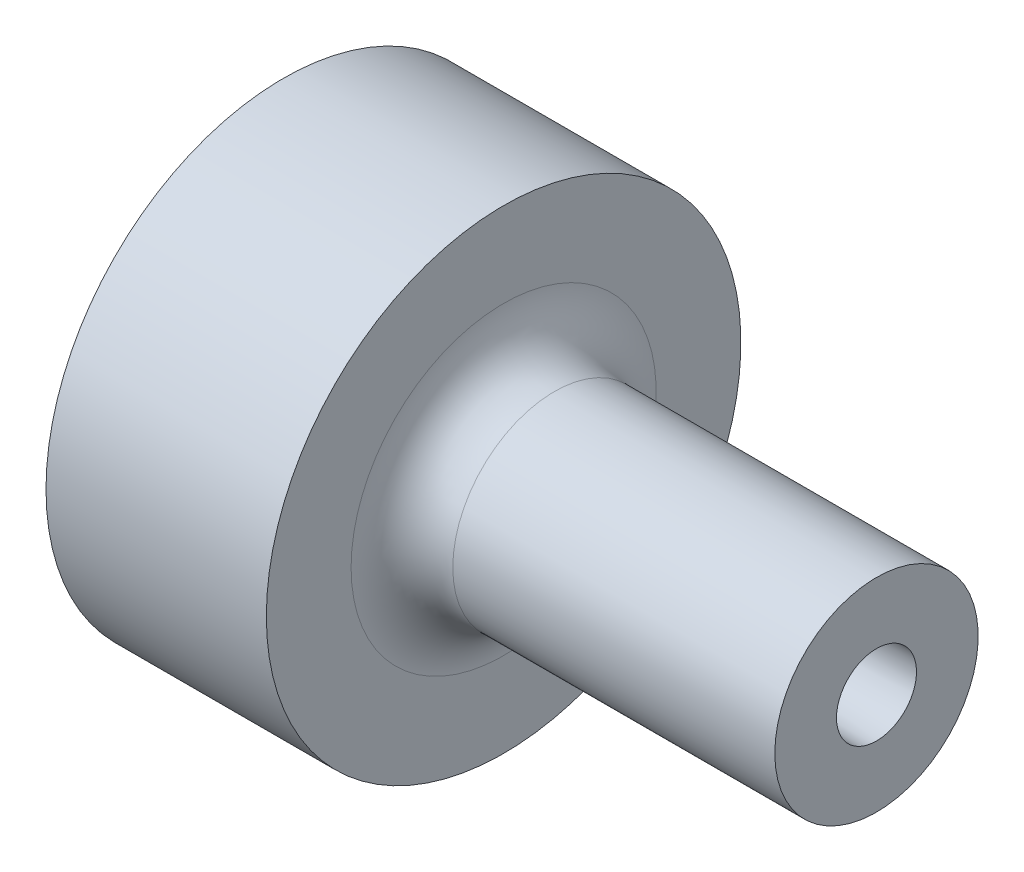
ISO-10303-21;
HEADER;
FILE_DESCRIPTION(('STEP AP214'),'2;1');
FILE_NAME('part.step','',(''),(''),'','','');
FILE_SCHEMA(('AUTOMOTIVE_DESIGN { 1 0 10303 214 1 1 1 1 }'));
ENDSEC;
DATA;
#1=APPLICATION_CONTEXT('core data for automotive mechanical design processes');
#2=APPLICATION_PROTOCOL_DEFINITION('international standard','automotive_design',2000,#1);
#3=PRODUCT_CONTEXT('',#1,'mechanical');
#4=PRODUCT('Part','Part','',(#3));
#5=PRODUCT_RELATED_PRODUCT_CATEGORY('part','',(#4));
#6=PRODUCT_DEFINITION_FORMATION('','',#4);
#7=PRODUCT_DEFINITION_CONTEXT('part definition',#1,'design');
#8=PRODUCT_DEFINITION('design','',#6,#7);
#9=PRODUCT_DEFINITION_SHAPE('','',#8);
#10=(LENGTH_UNIT() NAMED_UNIT(*) SI_UNIT(.MILLI.,.METRE.));
#11=(NAMED_UNIT(*) PLANE_ANGLE_UNIT() SI_UNIT($,.RADIAN.));
#12=(NAMED_UNIT(*) SI_UNIT($,.STERADIAN.) SOLID_ANGLE_UNIT());
#13=UNCERTAINTY_MEASURE_WITH_UNIT(LENGTH_MEASURE(1.E-05),#10,'distance_accuracy_value','');
#14=(GEOMETRIC_REPRESENTATION_CONTEXT(3) GLOBAL_UNCERTAINTY_ASSIGNED_CONTEXT((#13)) GLOBAL_UNIT_ASSIGNED_CONTEXT((#10,
#11,#12)) REPRESENTATION_CONTEXT('',''));
#15=CARTESIAN_POINT('',(0.,0.,0.));
#16=DIRECTION('',(0.,0.,1.));
#17=DIRECTION('',(1.,0.,0.));
#18=AXIS2_PLACEMENT_3D('',#15,#16,#17);
#19=CARTESIAN_POINT('',(0.,0.,0.));
#20=DIRECTION('',(-1.,0.,0.));
#21=DIRECTION('',(0.,0.,1.));
#22=AXIS2_PLACEMENT_3D('',#19,#20,#21);
#23=CYLINDRICAL_SURFACE('',#22,14.);
#24=CARTESIAN_POINT('',(13.,0.,0.));
#25=DIRECTION('',(-1.,0.,0.));
#26=DIRECTION('',(0.,0.,1.));
#27=AXIS2_PLACEMENT_3D('',#24,#25,#26);
#28=CIRCLE('',#27,14.);
#29=CARTESIAN_POINT('',(13.,0.,14.));
#30=VERTEX_POINT('',#29);
#31=EDGE_CURVE('E89',#30,#30,#28,.T.);
#32=ORIENTED_EDGE('',*,*,#31,.T.);
#33=EDGE_LOOP('',(#32));
#34=FACE_BOUND('',#33,.T.);
#35=CARTESIAN_POINT('',(0.,0.,0.));
#36=DIRECTION('',(-1.,0.,0.));
#37=DIRECTION('',(0.,0.,1.));
#38=AXIS2_PLACEMENT_3D('',#35,#36,#37);
#39=CIRCLE('',#38,14.);
#40=CARTESIAN_POINT('',(0.,0.,14.));
#41=VERTEX_POINT('',#40);
#42=EDGE_CURVE('E84',#41,#41,#39,.T.);
#43=ORIENTED_EDGE('',*,*,#42,.F.);
#44=EDGE_LOOP('',(#43));
#45=FACE_BOUND('',#44,.T.);
#46=CARTESIAN_POINT('',(6.5,-13.856406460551,-2.));
#47=CARTESIAN_POINT('',(6.61172417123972,-13.8564082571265,-1.99999534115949));
#48=CARTESIAN_POINT('',(6.72351471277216,-13.8577723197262,-1.99060664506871));
#49=CARTESIAN_POINT('',(6.9439746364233,-13.8630779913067,-1.95330740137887));
#50=CARTESIAN_POINT('',(7.05264079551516,-13.8670221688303,-1.92537839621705));
#51=CARTESIAN_POINT('',(7.26362870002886,-13.8770324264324,-1.85184738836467));
#52=CARTESIAN_POINT('',(7.36595507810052,-13.8830969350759,-1.80625847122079));
#53=CARTESIAN_POINT('',(7.56148972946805,-13.8966626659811,-1.69873175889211));
#54=CARTESIAN_POINT('',(7.65469934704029,-13.9041636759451,-1.63679637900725));
#55=CARTESIAN_POINT('',(7.83004829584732,-13.9198182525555,-1.49785346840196));
#56=CARTESIAN_POINT('',(7.91211171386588,-13.9279757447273,-1.42075056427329));
#57=CARTESIAN_POINT('',(8.06218155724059,-13.9439890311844,-1.25386707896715));
#58=CARTESIAN_POINT('',(8.13018723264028,-13.9518448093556,-1.16408582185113));
#59=CARTESIAN_POINT('',(8.25048909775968,-13.9664103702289,-0.973910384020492));
#60=CARTESIAN_POINT('',(8.30271571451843,-13.9731150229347,-0.873471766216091));
#61=CARTESIAN_POINT('',(8.38953073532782,-13.9845795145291,-0.665136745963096));
#62=CARTESIAN_POINT('',(8.4241199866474,-13.9893394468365,-0.557240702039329));
#63=CARTESIAN_POINT('',(8.47444920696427,-13.9963505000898,-0.337834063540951));
#64=CARTESIAN_POINT('',(8.49031606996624,-13.9986185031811,-0.226353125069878));
#65=CARTESIAN_POINT('',(8.5031438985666,-14.0004479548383,-0.00228956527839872));
#66=CARTESIAN_POINT('',(8.50010582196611,-14.0000095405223,0.110292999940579));
#67=CARTESIAN_POINT('',(8.47531062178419,-13.9964890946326,0.33249899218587));
#68=CARTESIAN_POINT('',(8.45369000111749,-13.9934263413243,0.442137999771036));
#69=CARTESIAN_POINT('',(8.39255744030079,-13.9850228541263,0.656215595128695));
#70=CARTESIAN_POINT('',(8.3530450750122,-13.9796820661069,0.760654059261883));
#71=CARTESIAN_POINT('',(8.25710925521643,-13.9672894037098,0.961781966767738));
#72=CARTESIAN_POINT('',(8.20062784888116,-13.9602316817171,1.05844339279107));
#73=CARTESIAN_POINT('',(8.07239950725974,-13.9451926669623,1.24096782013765));
#74=CARTESIAN_POINT('',(8.00065165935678,-13.9372113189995,1.32683017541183));
#75=CARTESIAN_POINT('',(7.843165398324,-13.921132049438,1.48612299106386));
#76=CARTESIAN_POINT('',(7.75730786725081,-13.9130337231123,1.55943569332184));
#77=CARTESIAN_POINT('',(7.57444547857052,-13.8977029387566,1.69062989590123));
#78=CARTESIAN_POINT('',(7.47744056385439,-13.890470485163,1.74851131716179));
#79=CARTESIAN_POINT('',(7.27491971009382,-13.8776905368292,1.84721301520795));
#80=CARTESIAN_POINT('',(7.1693981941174,-13.8721441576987,1.88802200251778));
#81=CARTESIAN_POINT('',(6.95290242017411,-13.8633846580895,1.9513062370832));
#82=CARTESIAN_POINT('',(6.84192850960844,-13.8601713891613,1.97378265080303));
#83=CARTESIAN_POINT('',(6.61872346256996,-13.8564698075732,1.99960390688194));
#84=CARTESIAN_POINT('',(6.50651197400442,-13.8559577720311,2.00311531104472));
#85=CARTESIAN_POINT('',(6.28310219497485,-13.8576537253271,1.9913480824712));
#86=CARTESIAN_POINT('',(6.17190387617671,-13.8598616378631,1.9760699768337));
#87=CARTESIAN_POINT('',(5.95418781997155,-13.8667269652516,1.92729837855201));
#88=CARTESIAN_POINT('',(5.84765127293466,-13.8713733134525,1.8938871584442));
#89=CARTESIAN_POINT('',(5.6416912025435,-13.8825829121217,1.80988306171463));
#90=CARTESIAN_POINT('',(5.54226800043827,-13.8891462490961,1.75928940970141));
#91=CARTESIAN_POINT('',(5.35260812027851,-13.9035064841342,1.64195360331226));
#92=CARTESIAN_POINT('',(5.26243903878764,-13.911311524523,1.57510320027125));
#93=CARTESIAN_POINT('',(5.09454027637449,-13.9272509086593,1.42730277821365));
#94=CARTESIAN_POINT('',(5.01681123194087,-13.9353852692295,1.34635203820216));
#95=CARTESIAN_POINT('',(4.8754047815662,-13.9511405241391,1.17191708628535));
#96=CARTESIAN_POINT('',(4.81183747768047,-13.9587570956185,1.07834317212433));
#97=CARTESIAN_POINT('',(4.70132443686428,-13.972552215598,0.881748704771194));
#98=CARTESIAN_POINT('',(4.65437828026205,-13.9787308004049,0.778728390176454));
#99=CARTESIAN_POINT('',(4.57861788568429,-13.9889347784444,0.566515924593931));
#100=CARTESIAN_POINT('',(4.54974241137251,-13.9929674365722,0.457345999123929));
#101=CARTESIAN_POINT('',(4.51074453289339,-13.9984555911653,0.235645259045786));
#102=CARTESIAN_POINT('',(4.50062101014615,-13.9999112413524,0.123114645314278));
#103=CARTESIAN_POINT('',(4.49943976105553,-14.0000800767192,-0.101043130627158));
#104=CARTESIAN_POINT('',(4.50821318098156,-13.998817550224,-0.212669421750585));
#105=CARTESIAN_POINT('',(4.54421615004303,-13.9937406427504,-0.432842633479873));
#106=CARTESIAN_POINT('',(4.57144565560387,-13.989926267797,-0.541389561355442));
#107=CARTESIAN_POINT('',(4.6435299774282,-13.9801722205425,-0.752283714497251));
#108=CARTESIAN_POINT('',(4.68837418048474,-13.9742338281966,-0.854634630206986));
#109=CARTESIAN_POINT('',(4.79439714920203,-13.960885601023,-1.05038570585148));
#110=CARTESIAN_POINT('',(4.8555763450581,-13.9534757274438,-1.14378562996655));
#111=CARTESIAN_POINT('',(4.99314771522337,-13.9379304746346,-1.31984194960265));
#112=CARTESIAN_POINT('',(5.06966490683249,-13.9297894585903,-1.40240016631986));
#113=CARTESIAN_POINT('',(5.2354775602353,-13.9137422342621,-1.55356716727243));
#114=CARTESIAN_POINT('',(5.32477602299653,-13.9058360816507,-1.6221726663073));
#115=CARTESIAN_POINT('',(5.51414543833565,-13.8911108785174,-1.74379523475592));
#116=CARTESIAN_POINT('',(5.61426869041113,-13.8842975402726,-1.79673154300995));
#117=CARTESIAN_POINT('',(5.82203229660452,-13.8725962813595,-1.88495902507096));
#118=CARTESIAN_POINT('',(5.92966459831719,-13.8677063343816,-1.92026877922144));
#119=CARTESIAN_POINT('',(6.11483642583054,-13.8615529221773,-1.96409255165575));
#120=CARTESIAN_POINT('',(6.19122433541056,-13.859633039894,-1.97753762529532));
#121=CARTESIAN_POINT('',(6.34506419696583,-13.857059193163,-1.99549291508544));
#122=CARTESIAN_POINT('',(6.42251613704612,-13.8564052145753,-2.00000323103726));
#123=CARTESIAN_POINT('',(6.5,-13.856406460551,-2.));
#124=B_SPLINE_CURVE_WITH_KNOTS('',3,(#46,#47,#48,#49,#50,#51,#52,#53,#54,#55,#56,#57,#58,#59,
#60,#61,#62,#63,#64,#65,#66,#67,#68,#69,#70,#71,#72,#73,#74,#75,#76,#77,#78,#79,#80,#81,#82,#83,
#84,#85,#86,#87,#88,#89,#90,#91,#92,#93,#94,#95,#96,#97,#98,#99,#100,#101,#102,#103,#104,#105,
#106,#107,#108,#109,#110,#111,#112,#113,#114,#115,#116,#117,#118,#119,#120,#121,#122,#123),
.UNSPECIFIED.,.T.,.F.,(4,2,2,2,2,2,2,2,2,2,2,2,2,2,2,2,2,2,2,2,2,2,2,2,2,2,2,2,2,2,2,2,2,2,2,2,
2,2,4),(0.,0.334889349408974,0.670112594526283,1.00508792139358,1.34001378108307,
1.6771171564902,2.01423851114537,2.35282530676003,2.6913958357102,3.02765822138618,
3.36390357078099,3.69769984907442,4.03150405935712,4.36646147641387,4.70143892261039,
5.03940517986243,5.37737316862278,5.7155642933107,6.05373389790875,6.3889286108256,
6.72411392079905,7.05779100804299,7.39148315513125,7.72746121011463,8.06345644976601,
8.40197921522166,8.74049343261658,9.07785422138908,9.41519488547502,9.74953375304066,
10.083871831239,10.4180087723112,10.7521545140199,11.0891434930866,11.426211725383,
11.7649881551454,12.103406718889,12.3356645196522,12.5679197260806),.UNSPECIFIED.);
#125=CARTESIAN_POINT('',(6.5,-13.856406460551,-2.));
#126=VERTEX_POINT('',#125);
#127=EDGE_CURVE('E10',#126,#126,#124,.T.);
#128=ORIENTED_EDGE('',*,*,#127,.F.);
#129=EDGE_LOOP('',(#128));
#130=FACE_BOUND('',#129,.T.);
#131=ADVANCED_FACE('F16',(#34,#45,#130),#23,.T.);
#132=CARTESIAN_POINT('',(0.,0.,0.));
#133=DIRECTION('',(1.,0.,0.));
#134=DIRECTION('',(0.,0.,-1.));
#135=AXIS2_PLACEMENT_3D('',#132,#133,#134);
#136=CONICAL_SURFACE('',#135,1.75,0.0174532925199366);
#137=CARTESIAN_POINT('',(35.,0.,0.));
#138=DIRECTION('',(-1.,0.,0.));
#139=DIRECTION('',(0.,0.,1.));
#140=AXIS2_PLACEMENT_3D('',#137,#138,#139);
#141=CIRCLE('',#140,2.36092727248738);
#142=CARTESIAN_POINT('',(35.,0.,2.36092727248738));
#143=VERTEX_POINT('',#142);
#144=EDGE_CURVE('E81',#143,#143,#141,.T.);
#145=ORIENTED_EDGE('',*,*,#144,.F.);
#146=EDGE_LOOP('',(#145));
#147=FACE_BOUND('',#146,.T.);
#148=CARTESIAN_POINT('',(0.856894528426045,0.,0.));
#149=DIRECTION('',(-1.,0.,0.));
#150=DIRECTION('',(0.,0.,1.));
#151=AXIS2_PLACEMENT_3D('',#148,#149,#150);
#152=CIRCLE('',#151,1.76495714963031);
#153=CARTESIAN_POINT('',(0.856894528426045,0.,1.76495714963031));
#154=VERTEX_POINT('',#153);
#155=EDGE_CURVE('E94',#154,#154,#152,.F.);
#156=ORIENTED_EDGE('',*,*,#155,.F.);
#157=EDGE_LOOP('',(#156));
#158=FACE_BOUND('',#157,.T.);
#159=ADVANCED_FACE('F45',(#147,#158),#136,.F.);
#160=CARTESIAN_POINT('',(16.,0.,0.));
#161=DIRECTION('',(-1.,0.,0.));
#162=DIRECTION('',(0.,0.,1.));
#163=AXIS2_PLACEMENT_3D('',#160,#161,#162);
#164=TOROIDAL_SURFACE('',#163,9.,3.);
#165=CARTESIAN_POINT('',(13.,0.,0.));
#166=DIRECTION('',(-1.,0.,0.));
#167=DIRECTION('',(0.,0.,1.));
#168=AXIS2_PLACEMENT_3D('',#165,#166,#167);
#169=CIRCLE('',#168,9.);
#170=CARTESIAN_POINT('',(13.,0.,9.));
#171=VERTEX_POINT('',#170);
#172=EDGE_CURVE('E91',#171,#171,#169,.T.);
#173=ORIENTED_EDGE('',*,*,#172,.F.);
#174=EDGE_LOOP('',(#173));
#175=FACE_BOUND('',#174,.T.);
#176=CARTESIAN_POINT('',(16.,0.,0.));
#177=DIRECTION('',(-1.,0.,0.));
#178=DIRECTION('',(0.,0.,1.));
#179=AXIS2_PLACEMENT_3D('',#176,#177,#178);
#180=CIRCLE('',#179,6.);
#181=CARTESIAN_POINT('',(16.,0.,6.));
#182=VERTEX_POINT('',#181);
#183=EDGE_CURVE('E28',#182,#182,#180,.T.);
#184=ORIENTED_EDGE('',*,*,#183,.T.);
#185=EDGE_LOOP('',(#184));
#186=FACE_BOUND('',#185,.T.);
#187=ADVANCED_FACE('F18',(#175,#186),#164,.F.);
#188=CARTESIAN_POINT('',(0.,0.,0.));
#189=DIRECTION('',(-1.,0.,0.));
#190=DIRECTION('',(0.,0.,1.));
#191=AXIS2_PLACEMENT_3D('',#188,#189,#190);
#192=CYLINDRICAL_SURFACE('',#191,6.);
#193=ORIENTED_EDGE('',*,*,#183,.F.);
#194=EDGE_LOOP('',(#193));
#195=FACE_BOUND('',#194,.T.);
#196=CARTESIAN_POINT('',(35.,0.,0.));
#197=DIRECTION('',(-1.,0.,0.));
#198=DIRECTION('',(0.,0.,1.));
#199=AXIS2_PLACEMENT_3D('',#196,#197,#198);
#200=CIRCLE('',#199,6.);
#201=CARTESIAN_POINT('',(35.,0.,6.));
#202=VERTEX_POINT('',#201);
#203=EDGE_CURVE('E80',#202,#202,#200,.T.);
#204=ORIENTED_EDGE('',*,*,#203,.T.);
#205=EDGE_LOOP('',(#204));
#206=FACE_BOUND('',#205,.T.);
#207=ADVANCED_FACE('F66',(#195,#206),#192,.T.);
#208=CARTESIAN_POINT('',(35.,6.,0.));
#209=DIRECTION('',(-1.,0.,0.));
#210=DIRECTION('',(0.,0.,1.));
#211=AXIS2_PLACEMENT_3D('',#208,#209,#210);
#212=PLANE('',#211);
#213=ORIENTED_EDGE('',*,*,#203,.F.);
#214=EDGE_LOOP('',(#213));
#215=FACE_BOUND('',#214,.T.);
#216=ORIENTED_EDGE('',*,*,#144,.T.);
#217=EDGE_LOOP('',(#216));
#218=FACE_BOUND('',#217,.T.);
#219=ADVANCED_FACE('F62',(#215,#218),#212,.F.);
#220=CARTESIAN_POINT('',(0.,1.75,0.));
#221=DIRECTION('',(1.,0.,0.));
#222=DIRECTION('',(0.,0.,-1.));
#223=AXIS2_PLACEMENT_3D('',#220,#221,#222);
#224=PLANE('',#223);
#225=CARTESIAN_POINT('',(0.,0.,0.));
#226=DIRECTION('',(-1.,0.,0.));
#227=DIRECTION('',(0.,0.,1.));
#228=AXIS2_PLACEMENT_3D('',#225,#226,#227);
#229=CIRCLE('',#228,5.);
#230=CARTESIAN_POINT('',(0.,0.,5.));
#231=VERTEX_POINT('',#230);
#232=EDGE_CURVE('E97',#231,#231,#229,.T.);
#233=ORIENTED_EDGE('',*,*,#232,.F.);
#234=EDGE_LOOP('',(#233));
#235=FACE_BOUND('',#234,.T.);
#236=ORIENTED_EDGE('',*,*,#42,.T.);
#237=EDGE_LOOP('',(#236));
#238=FACE_BOUND('',#237,.T.);
#239=ADVANCED_FACE('F60',(#235,#238),#224,.F.);
#240=CARTESIAN_POINT('',(13.,14.,0.));
#241=DIRECTION('',(-1.,0.,0.));
#242=DIRECTION('',(0.,0.,1.));
#243=AXIS2_PLACEMENT_3D('',#240,#241,#242);
#244=PLANE('',#243);
#245=ORIENTED_EDGE('',*,*,#31,.F.);
#246=EDGE_LOOP('',(#245));
#247=FACE_BOUND('',#246,.T.);
#248=ORIENTED_EDGE('',*,*,#172,.T.);
#249=EDGE_LOOP('',(#248));
#250=FACE_BOUND('',#249,.T.);
#251=ADVANCED_FACE('F58',(#247,#250),#244,.F.);
#252=CARTESIAN_POINT('',(-14.4672767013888,0.,0.));
#253=DIRECTION('',(-1.,0.,0.));
#254=DIRECTION('',(0.,0.,1.));
#255=AXIS2_PLACEMENT_3D('',#252,#253,#254);
#256=DEGENERATE_TOROIDAL_SURFACE('',#255,0.56308411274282,15.5,.F.);
#257=ORIENTED_EDGE('',*,*,#232,.T.);
#258=EDGE_LOOP('',(#257));
#259=FACE_BOUND('',#258,.T.);
#260=ORIENTED_EDGE('',*,*,#155,.T.);
#261=EDGE_LOOP('',(#260));
#262=FACE_BOUND('',#261,.T.);
#263=ADVANCED_FACE('F41',(#259,#262),#256,.T.);
#264=CARTESIAN_POINT('',(6.5,-14.,0.));
#265=DIRECTION('',(0.,-1.,0.));
#266=DIRECTION('',(0.,0.,-1.));
#267=AXIS2_PLACEMENT_3D('',#264,#265,#266);
#268=CYLINDRICAL_SURFACE('',#267,2.);
#269=CARTESIAN_POINT('',(6.5,-8.,0.));
#270=DIRECTION('',(0.,-1.,0.));
#271=DIRECTION('',(0.,0.,-1.));
#272=AXIS2_PLACEMENT_3D('',#269,#270,#271);
#273=CIRCLE('',#272,2.);
#274=CARTESIAN_POINT('',(6.5,-8.,-2.));
#275=VERTEX_POINT('',#274);
#276=EDGE_CURVE('E100',#275,#275,#273,.T.);
#277=ORIENTED_EDGE('',*,*,#276,.F.);
#278=EDGE_LOOP('',(#277));
#279=FACE_BOUND('',#278,.T.);
#280=ORIENTED_EDGE('',*,*,#127,.T.);
#281=EDGE_LOOP('',(#280));
#282=FACE_BOUND('',#281,.T.);
#283=ADVANCED_FACE('F33',(#279,#282),#268,.F.);
#284=CARTESIAN_POINT('',(6.5,-6.84529946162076,0.));
#285=DIRECTION('',(0.,-1.,0.));
#286=DIRECTION('',(0.,0.,-1.));
#287=AXIS2_PLACEMENT_3D('',#284,#285,#286);
#288=CONICAL_SURFACE('',#287,0.,1.0471975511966);
#289=ORIENTED_EDGE('',*,*,#276,.T.);
#290=EDGE_LOOP('',(#289));
#291=FACE_BOUND('',#290,.T.);
#292=CARTESIAN_POINT('',(6.5,-6.84529946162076,0.));
#293=VERTEX_POINT('',#292);
#294=VERTEX_LOOP('',#293);
#295=FACE_BOUND('',#294,.T.);
#296=ADVANCED_FACE('F31',(#291,#295),#288,.F.);
#297=CLOSED_SHELL('',(#131,#159,#187,#207,#219,#239,#251,#263,#283,#296));
#298=MANIFOLD_SOLID_BREP('B1',#297);
#299=ADVANCED_BREP_SHAPE_REPRESENTATION('',(#18,#298),#14);
#300=SHAPE_DEFINITION_REPRESENTATION(#9,#299);
ENDSEC;
END-ISO-10303-21;
